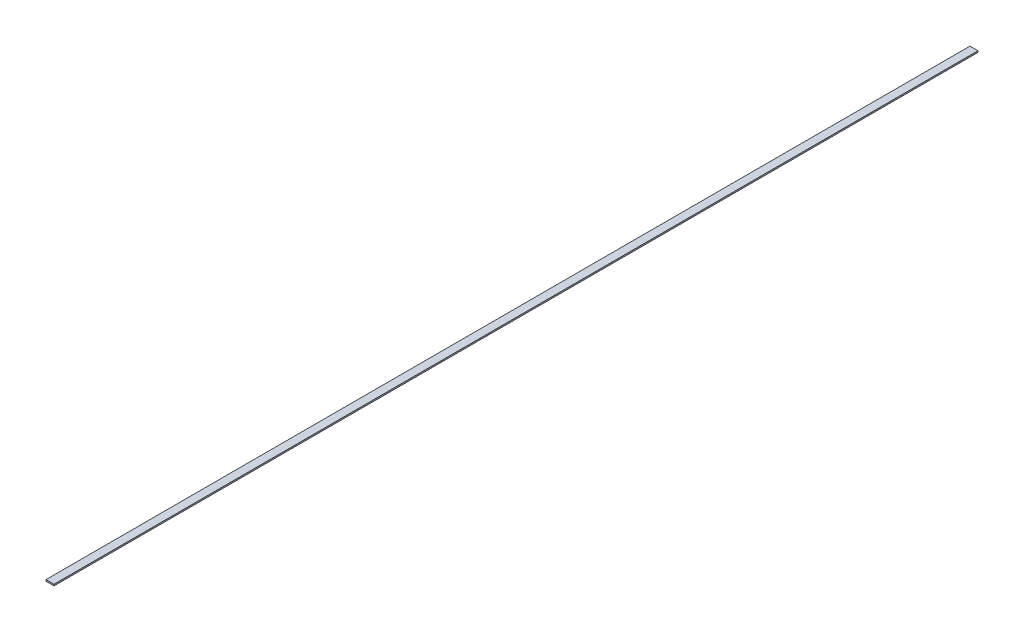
from build123d import *

# Parameters (mm, degrees)
SKETCH1_W      = 7.9375
SKETCH1_H      = 1.4478
EXTRUDE1_DEPTH = 457.2


with BuildPart() as part:
    # Sketch1 → Extrude1 (new, symmetric)
    with BuildSketch(Plane.XY):
        Rectangle(SKETCH1_W, SKETCH1_H)
    extrude(amount=EXTRUDE1_DEPTH, both=True)


solid = part.part
